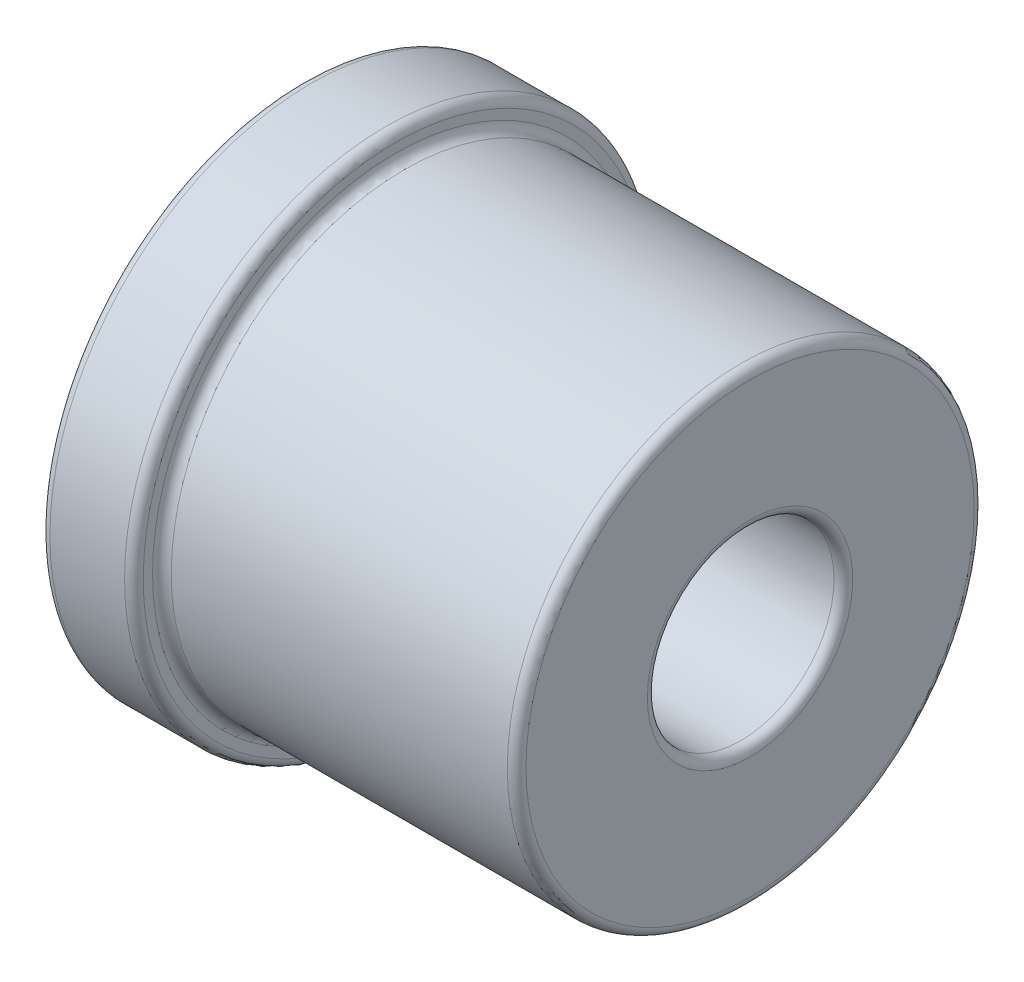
from build123d import *

# Parameters (mm, degrees)
ESQUISSE2_R             = 1
ENL_V_MAT_EXTRU_1_DEPTH = 7.222539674
CONG_1_R                = 0.1


with BuildPart() as part:
    # Esquisse1 → R_volution1 (revolve)
    with BuildSketch(Plane.XY, mode=Mode.PRIVATE) as r_volution1_sk:
        Polygon((-25.116863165, 2.8), (-24.116863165, 2.8), (-24.116863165, 2.5), (-20.316863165, 2.5), (-20.316863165, 0), (-25.116863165, 0), align=None)
    revolve(r_volution1_sk.sketch.rotate(Axis((-25.116863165, 0, 0), (1, 0, 0)), 90), axis=Axis((-25.116863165, 0, 0), (1, 0, 0)))

    # Esquisse2 → Enl_v. mat.-Extru.1 (cut, through all)
    with BuildSketch(Plane(origin=(-20.316863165, 0, 0), x_dir=(0, 0, -1), z_dir=(1, 0, 0))):
        Circle(ESQUISSE2_R)
    extrude(amount=-ENL_V_MAT_EXTRU_1_DEPTH, mode=Mode.SUBTRACT)

    # Cong_1
    cong_1_edges = [part.edges().sort_by_distance(p)[0] for p in [
        (-25.116863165, 0, 1),
        (-20.316863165, 0, 1),
        (-25.116863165, 0, -2.8),
        (-24.116863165, 0, -2.8),
        (-24.116863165, 0, -2.5),
        (-20.316863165, 0, -2.5),
    ]]
    fillet(cong_1_edges, radius=CONG_1_R)


solid = part.part
